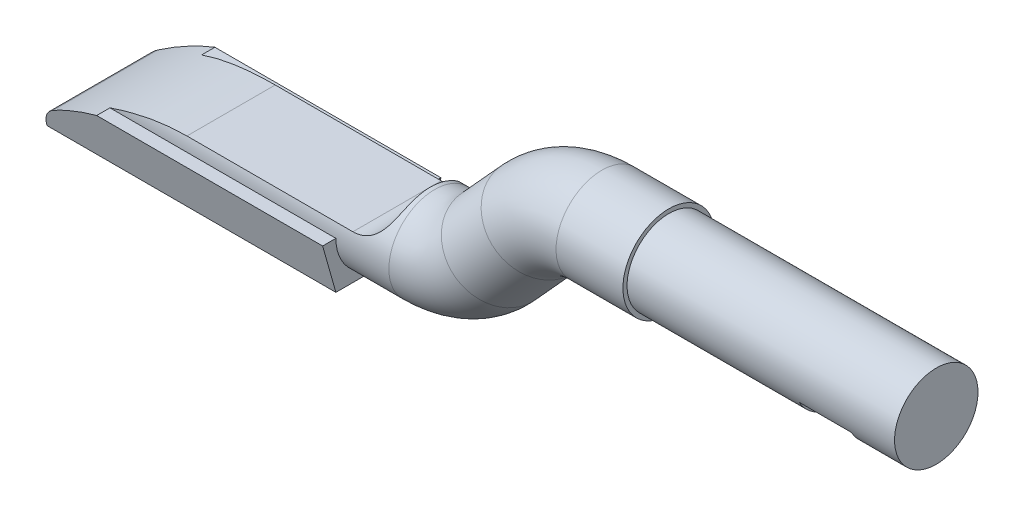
ISO-10303-21;
HEADER;
FILE_DESCRIPTION(('STEP AP214'),'2;1');
FILE_NAME('part.step','',(''),(''),'','','');
FILE_SCHEMA(('AUTOMOTIVE_DESIGN { 1 0 10303 214 1 1 1 1 }'));
ENDSEC;
DATA;
#1=APPLICATION_CONTEXT('core data for automotive mechanical design processes');
#2=APPLICATION_PROTOCOL_DEFINITION('international standard','automotive_design',2000,#1);
#3=PRODUCT_CONTEXT('',#1,'mechanical');
#4=PRODUCT('Part','Part','',(#3));
#5=PRODUCT_RELATED_PRODUCT_CATEGORY('part','',(#4));
#6=PRODUCT_DEFINITION_FORMATION('','',#4);
#7=PRODUCT_DEFINITION_CONTEXT('part definition',#1,'design');
#8=PRODUCT_DEFINITION('design','',#6,#7);
#9=PRODUCT_DEFINITION_SHAPE('','',#8);
#10=(LENGTH_UNIT() NAMED_UNIT(*) SI_UNIT(.MILLI.,.METRE.));
#11=(NAMED_UNIT(*) PLANE_ANGLE_UNIT() SI_UNIT($,.RADIAN.));
#12=(NAMED_UNIT(*) SI_UNIT($,.STERADIAN.) SOLID_ANGLE_UNIT());
#13=UNCERTAINTY_MEASURE_WITH_UNIT(LENGTH_MEASURE(1.E-05),#10,'distance_accuracy_value','');
#14=(GEOMETRIC_REPRESENTATION_CONTEXT(3) GLOBAL_UNCERTAINTY_ASSIGNED_CONTEXT((#13)) GLOBAL_UNIT_ASSIGNED_CONTEXT((#10,
#11,#12)) REPRESENTATION_CONTEXT('',''));
#15=CARTESIAN_POINT('',(0.,0.,0.));
#16=DIRECTION('',(0.,0.,1.));
#17=DIRECTION('',(1.,0.,0.));
#18=AXIS2_PLACEMENT_3D('',#15,#16,#17);
#19=CARTESIAN_POINT('',(-80.0862,-8.34390000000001,-5.6134));
#20=DIRECTION('',(0.,-1.,0.));
#21=DIRECTION('',(0.,0.,-1.));
#22=AXIS2_PLACEMENT_3D('',#19,#20,#21);
#23=PLANE('',#22);
#24=DIRECTION('',(0.,0.,1.));
#25=VECTOR('',#24,1.);
#26=CARTESIAN_POINT('',(-66.9643408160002,-8.34390000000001,-5.6134));
#27=LINE('',#26,#25);
#28=CARTESIAN_POINT('',(-66.9643408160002,-8.34390000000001,4.19292380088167));
#29=VERTEX_POINT('',#28);
#30=CARTESIAN_POINT('',(-66.9643408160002,-8.34390000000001,-4.19292380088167));
#31=VERTEX_POINT('',#30);
#32=EDGE_CURVE('E42',#29,#31,#27,.F.);
#33=ORIENTED_EDGE('',*,*,#32,.F.);
#34=DIRECTION('',(-1.,0.,0.));
#35=VECTOR('',#34,1.);
#36=CARTESIAN_POINT('',(-47.625,-8.34390000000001,4.19292380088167));
#37=LINE('',#36,#35);
#38=CARTESIAN_POINT('',(-51.2064,-8.34390000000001,4.19292380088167));
#39=VERTEX_POINT('',#38);
#40=EDGE_CURVE('E120',#39,#29,#37,.T.);
#41=ORIENTED_EDGE('',*,*,#40,.F.);
#42=DIRECTION('',(0.,0.,1.));
#43=VECTOR('',#42,1.);
#44=CARTESIAN_POINT('',(-51.2064,-8.34390000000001,-5.6134));
#45=LINE('',#44,#43);
#46=CARTESIAN_POINT('',(-51.2064,-8.34390000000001,-4.19292380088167));
#47=VERTEX_POINT('',#46);
#48=EDGE_CURVE('E130',#47,#39,#45,.T.);
#49=ORIENTED_EDGE('',*,*,#48,.F.);
#50=DIRECTION('',(-1.,0.,0.));
#51=VECTOR('',#50,1.);
#52=CARTESIAN_POINT('',(-47.625,-8.34390000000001,-4.19292380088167));
#53=LINE('',#52,#51);
#54=EDGE_CURVE('E57',#31,#47,#53,.F.);
#55=ORIENTED_EDGE('',*,*,#54,.F.);
#56=EDGE_LOOP('',(#33,#41,#49,#55));
#57=FACE_BOUND('',#56,.T.);
#58=ADVANCED_FACE('F34',(#57),#23,.F.);
#59=CARTESIAN_POINT('',(0.,0.,0.));
#60=DIRECTION('',(-1.,0.,0.));
#61=DIRECTION('',(0.,-1.,0.));
#62=AXIS2_PLACEMENT_3D('',#59,#60,#61);
#63=CYLINDRICAL_SURFACE('',#62,4.3561);
#64=CARTESIAN_POINT('',(-31.75,0.,0.));
#65=DIRECTION('',(1.,0.,0.));
#66=DIRECTION('',(0.,0.,-1.));
#67=AXIS2_PLACEMENT_3D('',#64,#65,#66);
#68=CIRCLE('',#67,4.3561);
#69=CARTESIAN_POINT('',(-31.75,4.3561,0.));
#70=VERTEX_POINT('',#69);
#71=EDGE_CURVE('E227',#70,#70,#68,.T.);
#72=ORIENTED_EDGE('',*,*,#71,.T.);
#73=EDGE_LOOP('',(#72));
#74=FACE_BOUND('',#73,.T.);
#75=CARTESIAN_POINT('',(-25.4,0.,0.));
#76=DIRECTION('',(1.,0.,0.));
#77=DIRECTION('',(0.,0.,-1.));
#78=AXIS2_PLACEMENT_3D('',#75,#76,#77);
#79=CIRCLE('',#78,4.3561);
#80=CARTESIAN_POINT('',(-25.4,0.,-4.3561));
#81=VERTEX_POINT('',#80);
#82=EDGE_CURVE('E231',#81,#81,#79,.T.);
#83=ORIENTED_EDGE('',*,*,#82,.F.);
#84=EDGE_LOOP('',(#83));
#85=FACE_BOUND('',#84,.T.);
#86=ADVANCED_FACE('F157',(#74,#85),#63,.T.);
#87=CARTESIAN_POINT('',(-31.75,-8.16610000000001,0.));
#88=DIRECTION('',(0.,0.,1.));
#89=DIRECTION('',(1.,0.,0.));
#90=AXIS2_PLACEMENT_3D('',#87,#88,#89);
#91=TOROIDAL_SURFACE('',#90,8.1661,4.3561);
#92=CARTESIAN_POINT('',(-37.7988897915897,-2.68010679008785,0.));
#93=DIRECTION('',(0.671800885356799,0.740731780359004,0.));
#94=DIRECTION('',(0.,0.,-1.));
#95=AXIS2_PLACEMENT_3D('',#92,#93,#94);
#96=CIRCLE('',#95,4.3561);
#97=CARTESIAN_POINT('',(-41.0255915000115,0.246325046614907,0.));
#98=VERTEX_POINT('',#97);
#99=EDGE_CURVE('E222',#98,#98,#96,.T.);
#100=CARTESIAN_POINT('',(-31.75,-8.16610000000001,0.));
#101=DIRECTION('',(0.,0.,1.));
#102=DIRECTION('',(1.,0.,0.));
#103=AXIS2_PLACEMENT_3D('',#100,#101,#102);
#104=CIRCLE('',#103,12.5222);
#105=EDGE_CURVE('',#70,#98,#104,.T.);
#106=ORIENTED_EDGE('',*,*,#71,.F.);
#107=ORIENTED_EDGE('',*,*,#99,.T.);
#108=ORIENTED_EDGE('',*,*,#105,.T.);
#109=ORIENTED_EDGE('',*,*,#105,.F.);
#110=EDGE_LOOP('',(#106,#108,#107,#109));
#111=FACE_BOUND('',#110,.T.);
#112=ADVANCED_FACE('F198',(#111),#91,.T.);
#113=CARTESIAN_POINT('',(-37.7988897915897,-2.68010679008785,0.));
#114=DIRECTION('',(-0.6718008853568,-0.740731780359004,0.));
#115=DIRECTION('',(0.740731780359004,-0.6718008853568,0.));
#116=AXIS2_PLACEMENT_3D('',#113,#114,#115);
#117=CYLINDRICAL_SURFACE('',#116,4.3561);
#118=CARTESIAN_POINT('',(-41.5761102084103,-6.84489320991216,0.));
#119=DIRECTION('',(0.6718008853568,0.740731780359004,0.));
#120=DIRECTION('',(0.,0.,-1.));
#121=AXIS2_PLACEMENT_3D('',#118,#119,#120);
#122=CIRCLE('',#121,4.3561);
#123=CARTESIAN_POINT('',(-38.3494084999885,-9.77132504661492,0.));
#124=VERTEX_POINT('',#123);
#125=EDGE_CURVE('E221',#124,#124,#122,.T.);
#126=ORIENTED_EDGE('',*,*,#125,.T.);
#127=EDGE_LOOP('',(#126));
#128=FACE_BOUND('',#127,.T.);
#129=ORIENTED_EDGE('',*,*,#99,.F.);
#130=EDGE_LOOP('',(#129));
#131=FACE_BOUND('',#130,.T.);
#132=ADVANCED_FACE('F204',(#128,#131),#117,.T.);
#133=CARTESIAN_POINT('',(-47.625,-1.35890000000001,0.));
#134=DIRECTION('',(0.,0.,-1.));
#135=DIRECTION('',(-1.,0.,0.));
#136=AXIS2_PLACEMENT_3D('',#133,#134,#135);
#137=TOROIDAL_SURFACE('',#136,8.1661,4.3561);
#138=CARTESIAN_POINT('',(-47.625,-9.525,0.));
#139=DIRECTION('',(1.,0.,0.));
#140=DIRECTION('',(0.,0.,-1.));
#141=AXIS2_PLACEMENT_3D('',#138,#139,#140);
#142=CIRCLE('',#141,4.3561);
#143=CARTESIAN_POINT('',(-47.625,-13.8811,0.));
#144=VERTEX_POINT('',#143);
#145=EDGE_CURVE('E218',#144,#144,#142,.T.);
#146=CARTESIAN_POINT('',(-47.625,-1.35890000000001,0.));
#147=DIRECTION('',(0.,0.,-1.));
#148=DIRECTION('',(-1.,0.,0.));
#149=AXIS2_PLACEMENT_3D('',#146,#147,#148);
#150=CIRCLE('',#149,12.5222);
#151=EDGE_CURVE('',#124,#144,#150,.T.);
#152=ORIENTED_EDGE('',*,*,#125,.F.);
#153=ORIENTED_EDGE('',*,*,#145,.T.);
#154=ORIENTED_EDGE('',*,*,#151,.T.);
#155=ORIENTED_EDGE('',*,*,#151,.F.);
#156=EDGE_LOOP('',(#152,#154,#153,#155));
#157=FACE_BOUND('',#156,.T.);
#158=ADVANCED_FACE('F207',(#157),#137,.T.);
#159=CARTESIAN_POINT('',(-47.625,-9.52500000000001,0.));
#160=DIRECTION('',(-1.,0.,0.));
#161=DIRECTION('',(0.,-1.,0.));
#162=AXIS2_PLACEMENT_3D('',#159,#160,#161);
#163=CYLINDRICAL_SURFACE('',#162,4.3561);
#164=DIRECTION('',(-1.,0.,0.));
#165=VECTOR('',#164,1.);
#166=CARTESIAN_POINT('',(-47.625,-9.525,-4.3561));
#167=LINE('',#166,#165);
#168=CARTESIAN_POINT('',(-52.6542,-9.525,-4.3561));
#169=VERTEX_POINT('',#168);
#170=CARTESIAN_POINT('',(-74.1131097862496,-9.525,-4.3561));
#171=VERTEX_POINT('',#170);
#172=EDGE_CURVE('E125',#169,#171,#167,.T.);
#173=ORIENTED_EDGE('',*,*,#172,.T.);
#174=CARTESIAN_POINT('',(-78.9116011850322,-11.8282064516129,-3.69741088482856));
#175=CARTESIAN_POINT('',(-78.7942508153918,-11.7533879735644,-3.743999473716));
#176=CARTESIAN_POINT('',(-78.6752527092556,-11.6790834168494,-3.78715211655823));
#177=CARTESIAN_POINT('',(-78.4343921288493,-11.5318732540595,-3.86718445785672));
#178=CARTESIAN_POINT('',(-78.3125309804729,-11.458967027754,-3.9040669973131));
#179=CARTESIAN_POINT('',(-78.0665609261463,-11.3150273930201,-3.97211827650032));
#180=CARTESIAN_POINT('',(-77.9424580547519,-11.243989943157,-4.00330039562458));
#181=CARTESIAN_POINT('',(-77.6920075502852,-11.103844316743,-4.06061416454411));
#182=CARTESIAN_POINT('',(-77.5656596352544,-11.0347363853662,-4.08674517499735));
#183=CARTESIAN_POINT('',(-77.1855448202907,-10.8316338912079,-4.15798427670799));
#184=CARTESIAN_POINT('',(-76.9288378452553,-10.7007655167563,-4.19643672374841));
#185=CARTESIAN_POINT('',(-76.4089822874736,-10.448438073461,-4.25908059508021));
#186=CARTESIAN_POINT('',(-76.1458288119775,-10.3269864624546,-4.28326081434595));
#187=CARTESIAN_POINT('',(-75.6311355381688,-10.1015806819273,-4.31918291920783));
#188=CARTESIAN_POINT('',(-75.3799135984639,-9.99700570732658,-4.33161464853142));
#189=CARTESIAN_POINT('',(-74.8735441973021,-9.79706220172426,-4.34875353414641));
#190=CARTESIAN_POINT('',(-74.6183960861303,-9.70169521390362,-4.35345939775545));
#191=CARTESIAN_POINT('',(-74.1046392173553,-9.5203607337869,-4.35704148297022));
#192=CARTESIAN_POINT('',(-73.8460291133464,-9.43439702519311,-4.35591536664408));
#193=CARTESIAN_POINT('',(-73.3258434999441,-9.27204201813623,-4.34950792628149));
#194=CARTESIAN_POINT('',(-73.0642676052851,-9.19565197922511,-4.34422605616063));
#195=CARTESIAN_POINT('',(-72.5373771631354,-9.05223739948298,-4.33097120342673));
#196=CARTESIAN_POINT('',(-72.2720511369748,-8.98525620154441,-4.32298630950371));
#197=CARTESIAN_POINT('',(-71.7391782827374,-8.86115054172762,-4.30567477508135));
#198=CARTESIAN_POINT('',(-71.4716316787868,-8.80402509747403,-4.2963482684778));
#199=CARTESIAN_POINT('',(-70.9347524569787,-8.69971641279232,-4.27753728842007));
#200=CARTESIAN_POINT('',(-70.6654208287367,-8.65252807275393,-4.26805289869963));
#201=CARTESIAN_POINT('',(-70.1251910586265,-8.56811795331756,-4.24992179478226));
#202=CARTESIAN_POINT('',(-69.8542929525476,-8.53089594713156,-4.24127506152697));
#203=CARTESIAN_POINT('',(-69.1475869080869,-8.44705520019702,-4.22096460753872));
#204=CARTESIAN_POINT('',(-68.7107685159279,-8.40828894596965,-4.21062242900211));
#205=CARTESIAN_POINT('',(-68.0553326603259,-8.36962014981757,-4.20010133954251));
#206=CARTESIAN_POINT('',(-67.8372786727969,-8.35997728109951,-4.19742675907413));
#207=CARTESIAN_POINT('',(-67.40093607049,-8.34711686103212,-4.19383184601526));
#208=CARTESIAN_POINT('',(-67.1826474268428,-8.34390022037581,-4.19291176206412));
#209=CARTESIAN_POINT('',(-66.9643408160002,-8.34390000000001,-4.19292380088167));
#210=B_SPLINE_CURVE_WITH_KNOTS('',3,(#174,#175,#176,#177,#178,#179,#180,#181,#182,#183,#184,
#185,#186,#187,#188,#189,#190,#191,#192,#193,#194,#195,#196,#197,#198,#199,#200,#201,#202,#203,
#204,#205,#206,#207,#208,#209),.UNSPECIFIED.,.F.,.F.,(4,2,2,2,2,2,2,2,2,2,2,2,2,2,2,2,2,4),(0.,
0.44018771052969,0.880175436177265,1.31911682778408,1.75811374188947,2.6294565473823,
3.50148253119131,4.31836648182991,5.13538709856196,5.95273526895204,6.77019086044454,
7.59129663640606,8.41232052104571,9.2329220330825,10.0535048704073,11.3685397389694,
12.0233056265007,12.6781642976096),.UNSPECIFIED.);
#211=EDGE_CURVE('E115',#171,#31,#210,.T.);
#212=ORIENTED_EDGE('',*,*,#211,.T.);
#213=ORIENTED_EDGE('',*,*,#54,.T.);
#214=CARTESIAN_POINT('',(-51.2064,-8.34390000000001,-4.19292380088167));
#215=CARTESIAN_POINT('',(-51.1220046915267,-8.34390928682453,-4.19290802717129));
#216=CARTESIAN_POINT('',(-51.0376115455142,-8.34053501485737,-4.19197542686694));
#217=CARTESIAN_POINT('',(-50.8693988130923,-8.32708937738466,-4.18816271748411));
#218=CARTESIAN_POINT('',(-50.7855792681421,-8.31701753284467,-4.18528246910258));
#219=CARTESIAN_POINT('',(-50.618989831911,-8.29022984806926,-4.17745562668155));
#220=CARTESIAN_POINT('',(-50.5362214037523,-8.27350561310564,-4.17250642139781));
#221=CARTESIAN_POINT('',(-50.3724594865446,-8.23358330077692,-4.16032215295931));
#222=CARTESIAN_POINT('',(-50.2914659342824,-8.21038545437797,-4.15308717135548));
#223=CARTESIAN_POINT('',(-50.0518042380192,-8.13129255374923,-4.12750759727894));
#224=CARTESIAN_POINT('',(-49.8965288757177,-8.06591013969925,-4.1052913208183));
#225=CARTESIAN_POINT('',(-49.6003540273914,-7.91280534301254,-4.04760021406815));
#226=CARTESIAN_POINT('',(-49.4594388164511,-7.82510777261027,-4.01214008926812));
#227=CARTESIAN_POINT('',(-49.2000268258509,-7.63470409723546,-3.9259321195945));
#228=CARTESIAN_POINT('',(-49.0809921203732,-7.53251593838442,-3.87566515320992));
#229=CARTESIAN_POINT('',(-48.8635781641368,-7.31720418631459,-3.75716380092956));
#230=CARTESIAN_POINT('',(-48.7651933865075,-7.20408353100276,-3.68893423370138));
#231=CARTESIAN_POINT('',(-48.5945421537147,-6.97937404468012,-3.53735375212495));
#232=CARTESIAN_POINT('',(-48.5212607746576,-6.86796564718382,-3.45487026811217));
#233=CARTESIAN_POINT('',(-48.3938534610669,-6.64756172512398,-3.27357989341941));
#234=CARTESIAN_POINT('',(-48.339732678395,-6.53856685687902,-3.17476862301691));
#235=CARTESIAN_POINT('',(-48.2459808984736,-6.32264373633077,-2.95722720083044));
#236=CARTESIAN_POINT('',(-48.2072297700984,-6.2161044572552,-2.83773813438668));
#237=CARTESIAN_POINT('',(-48.1444981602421,-6.0153442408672,-2.5853409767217));
#238=CARTESIAN_POINT('',(-48.1205260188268,-5.92113028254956,-2.45242535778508));
#239=CARTESIAN_POINT('',(-48.0800112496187,-5.7321740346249,-2.15107014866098));
#240=CARTESIAN_POINT('',(-48.0655627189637,-5.64034784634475,-1.98052760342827));
#241=CARTESIAN_POINT('',(-48.045641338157,-5.48000478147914,-1.62822861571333));
#242=CARTESIAN_POINT('',(-48.0401752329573,-5.4115054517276,-1.44646385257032));
#243=CARTESIAN_POINT('',(-48.0349273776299,-5.32209297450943,-1.15085005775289));
#244=CARTESIAN_POINT('',(-48.0337389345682,-5.29315006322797,-1.03937939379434));
#245=CARTESIAN_POINT('',(-48.0321963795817,-5.24417101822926,-0.814461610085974));
#246=CARTESIAN_POINT('',(-48.0318423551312,-5.22413581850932,-0.701014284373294));
#247=CARTESIAN_POINT('',(-48.0314546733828,-5.1931123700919,-0.472878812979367));
#248=CARTESIAN_POINT('',(-48.031421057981,-5.18212530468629,-0.358190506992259));
#249=CARTESIAN_POINT('',(-48.0313934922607,-5.16926836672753,-0.128303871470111));
#250=CARTESIAN_POINT('',(-48.0313995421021,-5.16739853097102,-0.0131055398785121));
#251=CARTESIAN_POINT('',(-48.0314009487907,-5.17295477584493,0.224133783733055));
#252=CARTESIAN_POINT('',(-48.0313956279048,-5.18095732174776,0.346161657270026));
#253=CARTESIAN_POINT('',(-48.0316039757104,-5.2071907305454,0.589118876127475));
#254=CARTESIAN_POINT('',(-48.0318176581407,-5.22542223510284,0.710048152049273));
#255=CARTESIAN_POINT('',(-48.032989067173,-5.2720066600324,0.950059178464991));
#256=CARTESIAN_POINT('',(-48.0339475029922,-5.30036921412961,1.06913905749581));
#257=CARTESIAN_POINT('',(-48.0374109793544,-5.36700547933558,1.3044703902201));
#258=CARTESIAN_POINT('',(-48.0399159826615,-5.40527895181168,1.42072191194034));
#259=CARTESIAN_POINT('',(-48.0475337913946,-5.49148841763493,1.64965697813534));
#260=CARTESIAN_POINT('',(-48.0526495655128,-5.53943537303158,1.76233630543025));
#261=CARTESIAN_POINT('',(-48.066782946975,-5.64454762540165,1.98308828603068));
#262=CARTESIAN_POINT('',(-48.0758010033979,-5.70171398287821,2.09116040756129));
#263=CARTESIAN_POINT('',(-48.0992017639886,-5.82452436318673,2.30149704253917));
#264=CARTESIAN_POINT('',(-48.1135739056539,-5.8901515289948,2.40377253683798));
#265=CARTESIAN_POINT('',(-48.1492989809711,-6.02907077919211,2.60166833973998));
#266=CARTESIAN_POINT('',(-48.1706485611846,-6.10235917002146,2.69729181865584));
#267=CARTESIAN_POINT('',(-48.214260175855,-6.23234203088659,2.85324554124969));
#268=CARTESIAN_POINT('',(-48.2343247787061,-6.28741426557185,2.91555404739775));
#269=CARTESIAN_POINT('',(-48.2792086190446,-6.4000992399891,3.03601670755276));
#270=CARTESIAN_POINT('',(-48.3040267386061,-6.45771137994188,3.09417183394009));
#271=CARTESIAN_POINT('',(-48.358873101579,-6.57474038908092,3.20595055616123));
#272=CARTESIAN_POINT('',(-48.3888974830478,-6.63415589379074,3.25957746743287));
#273=CARTESIAN_POINT('',(-48.4545447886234,-6.75401367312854,3.36206167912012));
#274=CARTESIAN_POINT('',(-48.4901678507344,-6.81445597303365,3.41091886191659));
#275=CARTESIAN_POINT('',(-48.5674662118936,-6.93577687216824,3.50391281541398));
#276=CARTESIAN_POINT('',(-48.6091737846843,-6.99665604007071,3.54802208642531));
#277=CARTESIAN_POINT('',(-48.6985745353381,-7.11751091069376,3.63111302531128));
#278=CARTESIAN_POINT('',(-48.746267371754,-7.17748666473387,3.67009498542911));
#279=CARTESIAN_POINT('',(-48.8475550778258,-7.29552256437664,3.74297349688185));
#280=CARTESIAN_POINT('',(-48.9011503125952,-7.35358259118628,3.77686973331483));
#281=CARTESIAN_POINT('',(-49.0139891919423,-7.46680037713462,3.83974162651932));
#282=CARTESIAN_POINT('',(-49.0732325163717,-7.52195830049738,3.86871756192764));
#283=CARTESIAN_POINT('',(-49.1916005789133,-7.62384756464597,3.91971766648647));
#284=CARTESIAN_POINT('',(-49.2502888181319,-7.67089471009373,3.94212702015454));
#285=CARTESIAN_POINT('',(-49.371700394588,-7.76124072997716,3.98336885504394));
#286=CARTESIAN_POINT('',(-49.4344250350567,-7.80453838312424,4.00220017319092));
#287=CARTESIAN_POINT('',(-49.5634776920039,-7.88685635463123,4.03659323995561));
#288=CARTESIAN_POINT('',(-49.6298057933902,-7.92587657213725,4.05215491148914));
#289=CARTESIAN_POINT('',(-49.7656166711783,-7.99922445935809,4.08033765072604));
#290=CARTESIAN_POINT('',(-49.8351005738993,-8.03355043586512,4.0929576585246));
#291=CARTESIAN_POINT('',(-50.0508853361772,-8.1304186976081,4.12741629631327));
#292=CARTESIAN_POINT('',(-50.2015568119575,-8.1849463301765,4.14510076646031));
#293=CARTESIAN_POINT('',(-50.5099350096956,-8.27070055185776,4.17185544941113));
#294=CARTESIAN_POINT('',(-50.667634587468,-8.30195025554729,4.1809342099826));
#295=CARTESIAN_POINT('',(-50.8897743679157,-8.32871297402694,4.18862084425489));
#296=CARTESIAN_POINT('',(-50.9530169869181,-8.33441066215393,4.19024108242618));
#297=CARTESIAN_POINT('',(-51.0796321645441,-8.34200001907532,4.19238992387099));
#298=CARTESIAN_POINT('',(-51.143004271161,-8.34389865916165,4.1929205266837));
#299=CARTESIAN_POINT('',(-51.2064,-8.34390000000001,4.19292380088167));
#300=B_SPLINE_CURVE_WITH_KNOTS('',3,(#214,#215,#216,#217,#218,#219,#220,#221,#222,#223,#224,
#225,#226,#227,#228,#229,#230,#231,#232,#233,#234,#235,#236,#237,#238,#239,#240,#241,#242,#243,
#244,#245,#246,#247,#248,#249,#250,#251,#252,#253,#254,#255,#256,#257,#258,#259,#260,#261,#262,
#263,#264,#265,#266,#267,#268,#269,#270,#271,#272,#273,#274,#275,#276,#277,#278,#279,#280,#281,
#282,#283,#284,#285,#286,#287,#288,#289,#290,#291,#292,#293,#294,#295,#296,#297,#298,#299),
.UNSPECIFIED.,.F.,.F.,(4,2,2,2,2,2,2,2,2,2,2,2,2,2,2,2,2,2,2,2,2,2,2,2,2,2,2,2,2,2,2,2,2,2,2,2,
2,2,2,2,2,2,4),(0.,0.253109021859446,0.506236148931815,0.759683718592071,1.01312224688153,
1.52022101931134,2.02675839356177,2.51838114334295,3.00987214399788,3.47812607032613,
3.94650580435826,4.43877575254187,4.9313232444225,5.51191742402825,6.09294737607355,
6.43814643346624,6.7833816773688,7.12866206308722,7.47394384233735,7.84037687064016,
8.20683288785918,8.57363830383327,8.9404348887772,9.30764948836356,9.67490635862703,
10.0414425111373,10.4078027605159,10.6641953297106,10.920527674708,11.1766706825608,
11.4328200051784,11.6903810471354,11.9479274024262,12.2054896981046,12.4630374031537,
12.6982188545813,12.9334766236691,13.1687399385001,13.4040878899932,13.8854602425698,
14.3663539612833,14.5568130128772,14.7469222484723),.UNSPECIFIED.);
#301=EDGE_CURVE('E132',#47,#39,#300,.T.);
#302=ORIENTED_EDGE('',*,*,#301,.T.);
#303=ORIENTED_EDGE('',*,*,#40,.T.);
#304=CARTESIAN_POINT('',(-66.9643408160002,-8.34390000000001,4.19292380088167));
#305=CARTESIAN_POINT('',(-67.120420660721,-8.34389996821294,4.19292047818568));
#306=CARTESIAN_POINT('',(-67.2764953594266,-8.34554422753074,4.1933873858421));
#307=CARTESIAN_POINT('',(-67.5885683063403,-8.35211976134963,4.19523253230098));
#308=CARTESIAN_POINT('',(-67.7445665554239,-8.35705099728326,4.19661076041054));
#309=CARTESIAN_POINT('',(-68.2123149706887,-8.37677127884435,4.20206830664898));
#310=CARTESIAN_POINT('',(-68.5238567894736,-8.39648689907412,4.20747050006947));
#311=CARTESIAN_POINT('',(-69.1456545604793,-8.44900346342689,4.22120472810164));
#312=CARTESIAN_POINT('',(-69.4559108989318,-8.4818001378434,4.22953580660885));
#313=CARTESIAN_POINT('',(-70.0747135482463,-8.56041349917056,4.24815390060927));
#314=CARTESIAN_POINT('',(-70.3832598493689,-8.60623026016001,4.25844092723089));
#315=CARTESIAN_POINT('',(-70.9889951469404,-8.70924893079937,4.27934971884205));
#316=CARTESIAN_POINT('',(-71.2862493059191,-8.76607231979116,4.28995247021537));
#317=CARTESIAN_POINT('',(-71.878218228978,-8.89181555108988,4.31030640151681));
#318=CARTESIAN_POINT('',(-72.1729330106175,-8.96073530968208,4.32005758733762));
#319=CARTESIAN_POINT('',(-72.759454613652,-9.11059334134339,4.33699914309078));
#320=CARTESIAN_POINT('',(-73.0512606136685,-9.19153491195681,4.34418880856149));
#321=CARTESIAN_POINT('',(-73.6313889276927,-9.36529747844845,4.35404173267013));
#322=CARTESIAN_POINT('',(-73.9197114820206,-9.45811764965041,4.35670530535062));
#323=CARTESIAN_POINT('',(-74.4124599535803,-9.62793915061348,4.3554638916));
#324=CARTESIAN_POINT('',(-74.617860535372,-9.70213377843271,4.35318348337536));
#325=CARTESIAN_POINT('',(-75.0262963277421,-9.85650872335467,4.34415585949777));
#326=CARTESIAN_POINT('',(-75.2293316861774,-9.93668866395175,4.33740892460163));
#327=CARTESIAN_POINT('',(-75.6324505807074,-10.1027828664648,4.31842003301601));
#328=CARTESIAN_POINT('',(-75.832537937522,-10.1886887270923,4.30618598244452));
#329=CARTESIAN_POINT('',(-76.2296534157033,-10.3661305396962,4.27506962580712));
#330=CARTESIAN_POINT('',(-76.4266819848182,-10.4576656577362,4.25618830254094));
#331=CARTESIAN_POINT('',(-76.8216216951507,-10.6482129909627,4.20996765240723));
#332=CARTESIAN_POINT('',(-77.0194535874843,-10.7473468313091,4.18244818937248));
#333=CARTESIAN_POINT('',(-77.4107477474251,-10.9507499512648,4.11755254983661));
#334=CARTESIAN_POINT('',(-77.6042114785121,-11.0550174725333,4.08017972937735));
#335=CARTESIAN_POINT('',(-77.9870429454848,-11.2686685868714,3.99356839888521));
#336=CARTESIAN_POINT('',(-78.1763836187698,-11.3780763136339,3.94426820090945));
#337=CARTESIAN_POINT('',(-78.4557492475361,-11.5449687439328,3.85995071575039));
#338=CARTESIAN_POINT('',(-78.5481560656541,-11.6011008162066,3.83009399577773));
#339=CARTESIAN_POINT('',(-78.7312305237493,-11.7141255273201,3.76663379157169));
#340=CARTESIAN_POINT('',(-78.8218977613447,-11.7710183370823,3.73302945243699));
#341=CARTESIAN_POINT('',(-78.9116011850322,-11.8282064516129,3.69741088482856));
#342=B_SPLINE_CURVE_WITH_KNOTS('',3,(#304,#305,#306,#307,#308,#309,#310,#311,#312,#313,#314,
#315,#316,#317,#318,#319,#320,#321,#322,#323,#324,#325,#326,#327,#328,#329,#330,#331,#332,#333,
#334,#335,#336,#337,#338,#339,#340,#341),.UNSPECIFIED.,.F.,.F.,(4,2,2,2,2,2,2,2,2,2,2,2,2,2,2,2,
2,2,4),(0.,0.468219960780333,0.936434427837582,1.87274950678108,2.80875921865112,
3.74477425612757,4.65299182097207,5.56120310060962,6.46966396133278,7.37806178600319,
8.03314433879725,8.68818571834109,9.34228629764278,9.99629020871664,10.6649567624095,
11.3333958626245,12.0053689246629,12.3417977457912,12.6783034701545),.UNSPECIFIED.);
#343=CARTESIAN_POINT('',(-74.1131097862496,-9.525,4.3561));
#344=VERTEX_POINT('',#343);
#345=EDGE_CURVE('E49',#29,#344,#342,.T.);
#346=ORIENTED_EDGE('',*,*,#345,.T.);
#347=DIRECTION('',(-1.,0.,0.));
#348=VECTOR('',#347,1.);
#349=CARTESIAN_POINT('',(-47.625,-9.525,4.3561));
#350=LINE('',#349,#348);
#351=CARTESIAN_POINT('',(-52.6542,-9.525,4.3561));
#352=VERTEX_POINT('',#351);
#353=EDGE_CURVE('E135',#344,#352,#350,.F.);
#354=ORIENTED_EDGE('',*,*,#353,.T.);
#355=CARTESIAN_POINT('',(-52.6542,-9.52500000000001,0.));
#356=DIRECTION('',(1.,0.,0.));
#357=DIRECTION('',(0.,0.,-1.));
#358=AXIS2_PLACEMENT_3D('',#355,#356,#357);
#359=CIRCLE('',#358,4.3561);
#360=EDGE_CURVE('E243',#352,#169,#359,.T.);
#361=ORIENTED_EDGE('',*,*,#360,.T.);
#362=EDGE_LOOP('',(#173,#212,#213,#302,#303,#346,#354,#361));
#363=FACE_BOUND('',#362,.T.);
#364=ORIENTED_EDGE('',*,*,#145,.F.);
#365=EDGE_LOOP('',(#364));
#366=FACE_BOUND('',#365,.T.);
#367=ADVANCED_FACE('F122',(#363,#366),#163,.T.);
#368=CARTESIAN_POINT('',(-25.4,0.,0.));
#369=DIRECTION('',(1.,0.,0.));
#370=DIRECTION('',(0.,0.,-1.));
#371=AXIS2_PLACEMENT_3D('',#368,#369,#370);
#372=PLANE('',#371);
#373=CARTESIAN_POINT('',(-25.4,0.,0.));
#374=DIRECTION('',(1.,0.,0.));
#375=DIRECTION('',(0.,0.,-1.));
#376=AXIS2_PLACEMENT_3D('',#373,#374,#375);
#377=CIRCLE('',#376,3.9624);
#378=CARTESIAN_POINT('',(-25.4,0.,-3.9624));
#379=VERTEX_POINT('',#378);
#380=EDGE_CURVE('E234',#379,#379,#377,.T.);
#381=ORIENTED_EDGE('',*,*,#380,.F.);
#382=EDGE_LOOP('',(#381));
#383=FACE_BOUND('',#382,.T.);
#384=ORIENTED_EDGE('',*,*,#82,.T.);
#385=EDGE_LOOP('',(#384));
#386=FACE_BOUND('',#385,.T.);
#387=ADVANCED_FACE('F193',(#383,#386),#372,.T.);
#388=CARTESIAN_POINT('',(-25.4,0.,0.));
#389=DIRECTION('',(1.,0.,0.));
#390=DIRECTION('',(0.,0.,-1.));
#391=AXIS2_PLACEMENT_3D('',#388,#389,#390);
#392=CYLINDRICAL_SURFACE('',#391,3.9624);
#393=DIRECTION('',(1.,0.,0.));
#394=VECTOR('',#393,1.);
#395=CARTESIAN_POINT('',(-25.4,-1.8796,3.48822556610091));
#396=LINE('',#395,#394);
#397=CARTESIAN_POINT('',(-4.572,-1.8796,3.48822556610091));
#398=VERTEX_POINT('',#397);
#399=CARTESIAN_POINT('',(-9.525,-1.8796,3.48822556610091));
#400=VERTEX_POINT('',#399);
#401=EDGE_CURVE('E241',#398,#400,#396,.F.);
#402=ORIENTED_EDGE('',*,*,#401,.F.);
#403=CARTESIAN_POINT('',(-4.572,0.,0.));
#404=DIRECTION('',(1.,0.,0.));
#405=DIRECTION('',(0.,0.,-1.));
#406=AXIS2_PLACEMENT_3D('',#403,#404,#405);
#407=CIRCLE('',#406,3.9624);
#408=CARTESIAN_POINT('',(-4.572,-1.8796,-3.48822556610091));
#409=VERTEX_POINT('',#408);
#410=EDGE_CURVE('E239',#409,#398,#407,.F.);
#411=ORIENTED_EDGE('',*,*,#410,.F.);
#412=DIRECTION('',(1.,0.,0.));
#413=VECTOR('',#412,1.);
#414=CARTESIAN_POINT('',(-25.4,-1.8796,-3.48822556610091));
#415=LINE('',#414,#413);
#416=CARTESIAN_POINT('',(-9.525,-1.8796,-3.48822556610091));
#417=VERTEX_POINT('',#416);
#418=EDGE_CURVE('E224',#417,#409,#415,.T.);
#419=ORIENTED_EDGE('',*,*,#418,.F.);
#420=CARTESIAN_POINT('',(-9.525,0.,0.));
#421=DIRECTION('',(-1.,0.,0.));
#422=DIRECTION('',(0.,0.,1.));
#423=AXIS2_PLACEMENT_3D('',#420,#421,#422);
#424=CIRCLE('',#423,3.9624);
#425=EDGE_CURVE('E236',#400,#417,#424,.F.);
#426=ORIENTED_EDGE('',*,*,#425,.F.);
#427=EDGE_LOOP('',(#402,#411,#419,#426));
#428=FACE_BOUND('',#427,.T.);
#429=ORIENTED_EDGE('',*,*,#380,.T.);
#430=EDGE_LOOP('',(#429));
#431=FACE_BOUND('',#430,.T.);
#432=CARTESIAN_POINT('',(0.,0.,0.));
#433=DIRECTION('',(1.,0.,0.));
#434=DIRECTION('',(0.,0.,-1.));
#435=AXIS2_PLACEMENT_3D('',#432,#433,#434);
#436=CIRCLE('',#435,3.9624);
#437=CARTESIAN_POINT('',(0.,0.,-3.9624));
#438=VERTEX_POINT('',#437);
#439=EDGE_CURVE('E285',#438,#438,#436,.T.);
#440=ORIENTED_EDGE('',*,*,#439,.F.);
#441=EDGE_LOOP('',(#440));
#442=FACE_BOUND('',#441,.T.);
#443=ADVANCED_FACE('F190',(#428,#431,#442),#392,.T.);
#444=CARTESIAN_POINT('',(0.,0.,0.));
#445=DIRECTION('',(1.,0.,0.));
#446=DIRECTION('',(0.,0.,-1.));
#447=AXIS2_PLACEMENT_3D('',#444,#445,#446);
#448=PLANE('',#447);
#449=ORIENTED_EDGE('',*,*,#439,.T.);
#450=EDGE_LOOP('',(#449));
#451=FACE_BOUND('',#450,.T.);
#452=ADVANCED_FACE('F36',(#451),#448,.T.);
#453=CARTESIAN_POINT('',(-4.572,-5.6896,-4.3561));
#454=DIRECTION('',(1.,0.,0.));
#455=DIRECTION('',(0.,0.,-1.));
#456=AXIS2_PLACEMENT_3D('',#453,#454,#455);
#457=PLANE('',#456);
#458=ORIENTED_EDGE('',*,*,#410,.T.);
#459=DIRECTION('',(0.,0.,1.));
#460=VECTOR('',#459,1.);
#461=CARTESIAN_POINT('',(-4.572,-1.8796,-4.3561));
#462=LINE('',#461,#460);
#463=EDGE_CURVE('E274',#409,#398,#462,.T.);
#464=ORIENTED_EDGE('',*,*,#463,.F.);
#465=EDGE_LOOP('',(#458,#464));
#466=FACE_BOUND('',#465,.T.);
#467=ADVANCED_FACE('F182',(#466),#457,.F.);
#468=CARTESIAN_POINT('',(-9.525,-5.6896,-4.3561));
#469=DIRECTION('',(-1.,0.,0.));
#470=DIRECTION('',(0.,0.,1.));
#471=AXIS2_PLACEMENT_3D('',#468,#469,#470);
#472=PLANE('',#471);
#473=ORIENTED_EDGE('',*,*,#425,.T.);
#474=DIRECTION('',(0.,0.,1.));
#475=VECTOR('',#474,1.);
#476=CARTESIAN_POINT('',(-9.525,-1.8796,-4.3561));
#477=LINE('',#476,#475);
#478=EDGE_CURVE('E282',#417,#400,#477,.T.);
#479=ORIENTED_EDGE('',*,*,#478,.T.);
#480=EDGE_LOOP('',(#473,#479));
#481=FACE_BOUND('',#480,.T.);
#482=ADVANCED_FACE('F179',(#481),#472,.F.);
#483=CARTESIAN_POINT('',(-9.525,-1.8796,-4.3561));
#484=DIRECTION('',(0.,1.,0.));
#485=DIRECTION('',(0.,0.,1.));
#486=AXIS2_PLACEMENT_3D('',#483,#484,#485);
#487=PLANE('',#486);
#488=ORIENTED_EDGE('',*,*,#401,.T.);
#489=ORIENTED_EDGE('',*,*,#478,.F.);
#490=ORIENTED_EDGE('',*,*,#418,.T.);
#491=ORIENTED_EDGE('',*,*,#463,.T.);
#492=EDGE_LOOP('',(#488,#489,#490,#491));
#493=FACE_BOUND('',#492,.T.);
#494=ADVANCED_FACE('F174',(#493),#487,.F.);
#495=CARTESIAN_POINT('',(-52.6542,-9.525,-5.6134));
#496=DIRECTION('',(0.,1.,0.));
#497=DIRECTION('',(0.,0.,1.));
#498=AXIS2_PLACEMENT_3D('',#495,#496,#497);
#499=PLANE('',#498);
#500=DIRECTION('',(0.,0.,1.));
#501=VECTOR('',#500,1.);
#502=CARTESIAN_POINT('',(-74.1131097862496,-9.525,-5.6134));
#503=LINE('',#502,#501);
#504=CARTESIAN_POINT('',(-74.1131097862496,-9.525,-5.6134));
#505=VERTEX_POINT('',#504);
#506=EDGE_CURVE('E127',#171,#505,#503,.F.);
#507=ORIENTED_EDGE('',*,*,#506,.F.);
#508=ORIENTED_EDGE('',*,*,#172,.F.);
#509=DIRECTION('',(0.,0.,-1.));
#510=VECTOR('',#509,1.);
#511=CARTESIAN_POINT('',(-52.6542,-9.525,-5.6134));
#512=LINE('',#511,#510);
#513=CARTESIAN_POINT('',(-52.6542,-9.525,-5.6134));
#514=VERTEX_POINT('',#513);
#515=EDGE_CURVE('E255',#169,#514,#512,.T.);
#516=ORIENTED_EDGE('',*,*,#515,.T.);
#517=DIRECTION('',(-1.,0.,0.));
#518=VECTOR('',#517,1.);
#519=CARTESIAN_POINT('',(-52.6542,-9.525,-5.6134));
#520=LINE('',#519,#518);
#521=EDGE_CURVE('E278',#514,#505,#520,.T.);
#522=ORIENTED_EDGE('',*,*,#521,.T.);
#523=EDGE_LOOP('',(#507,#508,#516,#522));
#524=FACE_BOUND('',#523,.T.);
#525=ADVANCED_FACE('F170',(#524),#499,.T.);
#526=DIRECTION('',(0.,0.,1.));
#527=VECTOR('',#526,1.);
#528=CARTESIAN_POINT('',(-74.1131097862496,-9.525,-5.6134));
#529=LINE('',#528,#527);
#530=CARTESIAN_POINT('',(-74.1131097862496,-9.525,5.6134));
#531=VERTEX_POINT('',#530);
#532=EDGE_CURVE('E391',#531,#344,#529,.F.);
#533=ORIENTED_EDGE('',*,*,#532,.F.);
#534=DIRECTION('',(-1.,0.,0.));
#535=VECTOR('',#534,1.);
#536=CARTESIAN_POINT('',(-52.6542,-9.525,5.6134));
#537=LINE('',#536,#535);
#538=CARTESIAN_POINT('',(-52.6542,-9.525,5.6134));
#539=VERTEX_POINT('',#538);
#540=EDGE_CURVE('E257',#539,#531,#537,.T.);
#541=ORIENTED_EDGE('',*,*,#540,.F.);
#542=EDGE_CURVE('E252',#539,#352,#512,.T.);
#543=ORIENTED_EDGE('',*,*,#542,.T.);
#544=ORIENTED_EDGE('',*,*,#353,.F.);
#545=EDGE_LOOP('',(#533,#541,#543,#544));
#546=FACE_BOUND('',#545,.T.);
#547=ADVANCED_FACE('F173',(#546),#499,.T.);
#548=CARTESIAN_POINT('',(-52.6542,-13.97,4.3561));
#549=DIRECTION('',(0.,-0.272178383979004,0.962246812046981));
#550=DIRECTION('',(0.,-0.962246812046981,-0.272178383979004));
#551=AXIS2_PLACEMENT_3D('',#548,#549,#550);
#552=PLANE('',#551);
#553=CARTESIAN_POINT('',(-77.5462,-13.97,4.3561));
#554=DIRECTION('',(0.,-0.272178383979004,0.962246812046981));
#555=DIRECTION('',(0.,0.962246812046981,0.272178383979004));
#556=AXIS2_PLACEMENT_3D('',#553,#554,#555);
#557=ELLIPSE('',#556,2.63965540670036,2.54);
#558=CARTESIAN_POINT('',(-80.0862,-13.97,4.3561));
#559=VERTEX_POINT('',#558);
#560=CARTESIAN_POINT('',(-78.9116011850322,-11.8282064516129,4.96192160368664));
#561=VERTEX_POINT('',#560);
#562=EDGE_CURVE('E381',#559,#561,#557,.F.);
#563=ORIENTED_EDGE('',*,*,#562,.F.);
#564=DIRECTION('',(-1.,0.,0.));
#565=VECTOR('',#564,1.);
#566=CARTESIAN_POINT('',(-52.6542,-13.97,4.3561));
#567=LINE('',#566,#565);
#568=CARTESIAN_POINT('',(-52.6542,-13.97,4.3561));
#569=VERTEX_POINT('',#568);
#570=EDGE_CURVE('E271',#569,#559,#567,.T.);
#571=ORIENTED_EDGE('',*,*,#570,.F.);
#572=DIRECTION('',(0.,0.962246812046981,0.272178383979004));
#573=VECTOR('',#572,1.);
#574=CARTESIAN_POINT('',(-52.6542,-13.97,4.3561));
#575=LINE('',#574,#573);
#576=EDGE_CURVE('E263',#569,#539,#575,.T.);
#577=ORIENTED_EDGE('',*,*,#576,.T.);
#578=ORIENTED_EDGE('',*,*,#540,.T.);
#579=CARTESIAN_POINT('',(-66.9643408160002,-30.5689,-0.339017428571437));
#580=DIRECTION('',(0.,-0.272178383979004,0.962246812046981));
#581=DIRECTION('',(0.,0.962246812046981,0.272178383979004));
#582=AXIS2_PLACEMENT_3D('',#579,#580,#581);
#583=ELLIPSE('',#582,23.0969848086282,22.225);
#584=EDGE_CURVE('E126',#561,#531,#583,.F.);
#585=ORIENTED_EDGE('',*,*,#584,.F.);
#586=EDGE_LOOP('',(#563,#571,#577,#578,#585));
#587=FACE_BOUND('',#586,.T.);
#588=ADVANCED_FACE('F165',(#587),#552,.T.);
#589=CARTESIAN_POINT('',(-52.6542,-13.97,4.3561));
#590=DIRECTION('',(0.,-1.,0.));
#591=DIRECTION('',(0.,0.,-1.));
#592=AXIS2_PLACEMENT_3D('',#589,#590,#591);
#593=PLANE('',#592);
#594=DIRECTION('',(0.,0.,1.));
#595=VECTOR('',#594,1.);
#596=CARTESIAN_POINT('',(-80.0862,-13.97,4.3561));
#597=LINE('',#596,#595);
#598=CARTESIAN_POINT('',(-80.0862,-13.97,-4.3561));
#599=VERTEX_POINT('',#598);
#600=EDGE_CURVE('E269',#599,#559,#597,.T.);
#601=ORIENTED_EDGE('',*,*,#600,.F.);
#602=DIRECTION('',(-1.,0.,0.));
#603=VECTOR('',#602,1.);
#604=CARTESIAN_POINT('',(-52.6542,-13.97,-4.3561));
#605=LINE('',#604,#603);
#606=CARTESIAN_POINT('',(-52.6542,-13.97,-4.3561));
#607=VERTEX_POINT('',#606);
#608=EDGE_CURVE('E275',#607,#599,#605,.T.);
#609=ORIENTED_EDGE('',*,*,#608,.F.);
#610=DIRECTION('',(0.,0.,1.));
#611=VECTOR('',#610,1.);
#612=CARTESIAN_POINT('',(-52.6542,-13.97,4.3561));
#613=LINE('',#612,#611);
#614=EDGE_CURVE('E261',#607,#569,#613,.T.);
#615=ORIENTED_EDGE('',*,*,#614,.T.);
#616=ORIENTED_EDGE('',*,*,#570,.T.);
#617=EDGE_LOOP('',(#601,#609,#615,#616));
#618=FACE_BOUND('',#617,.T.);
#619=ADVANCED_FACE('F162',(#618),#593,.T.);
#620=CARTESIAN_POINT('',(-52.6542,-13.97,-4.3561));
#621=DIRECTION('',(0.,-0.272178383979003,-0.962246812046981));
#622=DIRECTION('',(0.,0.962246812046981,-0.272178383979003));
#623=AXIS2_PLACEMENT_3D('',#620,#621,#622);
#624=PLANE('',#623);
#625=CARTESIAN_POINT('',(-77.5462,-13.97,-4.3561));
#626=DIRECTION('',(0.,-0.272178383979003,-0.962246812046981));
#627=DIRECTION('',(0.,-0.962246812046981,0.272178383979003));
#628=AXIS2_PLACEMENT_3D('',#625,#626,#627);
#629=ELLIPSE('',#628,2.63965540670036,2.54);
#630=CARTESIAN_POINT('',(-78.9116011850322,-11.8282064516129,-4.96192160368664));
#631=VERTEX_POINT('',#630);
#632=EDGE_CURVE('E11',#631,#599,#629,.F.);
#633=ORIENTED_EDGE('',*,*,#632,.F.);
#634=CARTESIAN_POINT('',(-66.9643408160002,-30.5689,0.339017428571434));
#635=DIRECTION('',(0.,-0.272178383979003,-0.962246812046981));
#636=DIRECTION('',(0.,-0.962246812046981,0.272178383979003));
#637=AXIS2_PLACEMENT_3D('',#634,#635,#636);
#638=ELLIPSE('',#637,23.0969848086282,22.225);
#639=EDGE_CURVE('E389',#505,#631,#638,.F.);
#640=ORIENTED_EDGE('',*,*,#639,.F.);
#641=ORIENTED_EDGE('',*,*,#521,.F.);
#642=DIRECTION('',(0.,-0.962246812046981,0.272178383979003));
#643=VECTOR('',#642,1.);
#644=CARTESIAN_POINT('',(-52.6542,-13.97,-4.3561));
#645=LINE('',#644,#643);
#646=EDGE_CURVE('E258',#514,#607,#645,.T.);
#647=ORIENTED_EDGE('',*,*,#646,.T.);
#648=ORIENTED_EDGE('',*,*,#608,.T.);
#649=EDGE_LOOP('',(#633,#640,#641,#647,#648));
#650=FACE_BOUND('',#649,.T.);
#651=ADVANCED_FACE('F160',(#650),#624,.T.);
#652=CARTESIAN_POINT('',(-52.6542,0.,0.));
#653=DIRECTION('',(1.,0.,0.));
#654=DIRECTION('',(0.,0.,-1.));
#655=AXIS2_PLACEMENT_3D('',#652,#653,#654);
#656=PLANE('',#655);
#657=ORIENTED_EDGE('',*,*,#360,.F.);
#658=ORIENTED_EDGE('',*,*,#542,.F.);
#659=ORIENTED_EDGE('',*,*,#576,.F.);
#660=ORIENTED_EDGE('',*,*,#614,.F.);
#661=ORIENTED_EDGE('',*,*,#646,.F.);
#662=ORIENTED_EDGE('',*,*,#515,.F.);
#663=EDGE_LOOP('',(#657,#658,#659,#660,#661,#662));
#664=FACE_BOUND('',#663,.T.);
#665=ADVANCED_FACE('F151',(#664),#656,.T.);
#666=CARTESIAN_POINT('',(-51.2064,-5.16890000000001,-5.6134));
#667=DIRECTION('',(0.,0.,1.));
#668=DIRECTION('',(1.,0.,0.));
#669=AXIS2_PLACEMENT_3D('',#666,#667,#668);
#670=CYLINDRICAL_SURFACE('',#669,3.175);
#671=ORIENTED_EDGE('',*,*,#48,.T.);
#672=ORIENTED_EDGE('',*,*,#301,.F.);
#673=EDGE_LOOP('',(#671,#672));
#674=FACE_BOUND('',#673,.T.);
#675=ADVANCED_FACE('F146',(#674),#670,.F.);
#676=CARTESIAN_POINT('',(-66.9643408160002,-30.5689,-5.6134));
#677=DIRECTION('',(0.,0.,1.));
#678=DIRECTION('',(1.,0.,0.));
#679=AXIS2_PLACEMENT_3D('',#676,#677,#678);
#680=CYLINDRICAL_SURFACE('',#679,22.225);
#681=ORIENTED_EDGE('',*,*,#32,.T.);
#682=ORIENTED_EDGE('',*,*,#211,.F.);
#683=ORIENTED_EDGE('',*,*,#506,.T.);
#684=ORIENTED_EDGE('',*,*,#639,.T.);
#685=DIRECTION('',(0.,0.,1.));
#686=VECTOR('',#685,1.);
#687=CARTESIAN_POINT('',(-78.9116011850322,-11.8282064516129,-5.6134));
#688=LINE('',#687,#686);
#689=EDGE_CURVE('E383',#631,#561,#688,.T.);
#690=ORIENTED_EDGE('',*,*,#689,.T.);
#691=ORIENTED_EDGE('',*,*,#584,.T.);
#692=ORIENTED_EDGE('',*,*,#532,.T.);
#693=ORIENTED_EDGE('',*,*,#345,.F.);
#694=EDGE_LOOP('',(#681,#682,#683,#684,#690,#691,#692,#693));
#695=FACE_BOUND('',#694,.T.);
#696=ADVANCED_FACE('F114',(#695),#680,.T.);
#697=CARTESIAN_POINT('',(-77.5462,-13.97,-5.6134));
#698=DIRECTION('',(0.,0.,1.));
#699=DIRECTION('',(1.,0.,0.));
#700=AXIS2_PLACEMENT_3D('',#697,#698,#699);
#701=CYLINDRICAL_SURFACE('',#700,2.54);
#702=ORIENTED_EDGE('',*,*,#562,.T.);
#703=ORIENTED_EDGE('',*,*,#689,.F.);
#704=ORIENTED_EDGE('',*,*,#632,.T.);
#705=ORIENTED_EDGE('',*,*,#600,.T.);
#706=EDGE_LOOP('',(#702,#703,#704,#705));
#707=FACE_BOUND('',#706,.T.);
#708=ADVANCED_FACE('F153',(#707),#701,.T.);
#709=CLOSED_SHELL('',(#58,#86,#112,#132,#158,#367,#387,#443,#452,#467,#482,#494,#525,#547,#588,
#619,#651,#665,#675,#696,#708));
#710=MANIFOLD_SOLID_BREP('B2',#709);
#711=ADVANCED_BREP_SHAPE_REPRESENTATION('',(#18,#710),#14);
#712=SHAPE_DEFINITION_REPRESENTATION(#9,#711);
ENDSEC;
END-ISO-10303-21;
